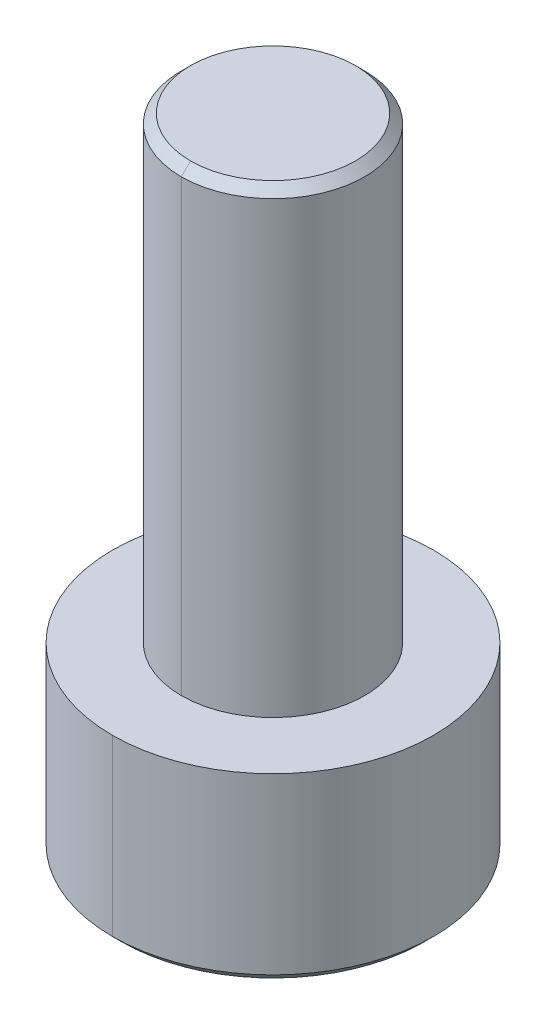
ISO-10303-21;
HEADER;
FILE_DESCRIPTION(('STEP AP214'),'2;1');
FILE_NAME('part.step','',(''),(''),'','','');
FILE_SCHEMA(('AUTOMOTIVE_DESIGN { 1 0 10303 214 1 1 1 1 }'));
ENDSEC;
DATA;
#1=APPLICATION_CONTEXT('core data for automotive mechanical design processes');
#2=APPLICATION_PROTOCOL_DEFINITION('international standard','automotive_design',2000,#1);
#3=PRODUCT_CONTEXT('',#1,'mechanical');
#4=PRODUCT('Part','Part','',(#3));
#5=PRODUCT_RELATED_PRODUCT_CATEGORY('part','',(#4));
#6=PRODUCT_DEFINITION_FORMATION('','',#4);
#7=PRODUCT_DEFINITION_CONTEXT('part definition',#1,'design');
#8=PRODUCT_DEFINITION('design','',#6,#7);
#9=PRODUCT_DEFINITION_SHAPE('','',#8);
#10=(LENGTH_UNIT() NAMED_UNIT(*) SI_UNIT(.MILLI.,.METRE.));
#11=(NAMED_UNIT(*) PLANE_ANGLE_UNIT() SI_UNIT($,.RADIAN.));
#12=(NAMED_UNIT(*) SI_UNIT($,.STERADIAN.) SOLID_ANGLE_UNIT());
#13=UNCERTAINTY_MEASURE_WITH_UNIT(LENGTH_MEASURE(1.E-05),#10,'distance_accuracy_value','');
#14=(GEOMETRIC_REPRESENTATION_CONTEXT(3) GLOBAL_UNCERTAINTY_ASSIGNED_CONTEXT((#13)) GLOBAL_UNIT_ASSIGNED_CONTEXT((#10,
#11,#12)) REPRESENTATION_CONTEXT('',''));
#15=CARTESIAN_POINT('',(0.,0.,0.));
#16=DIRECTION('',(0.,0.,1.));
#17=DIRECTION('',(1.,0.,0.));
#18=AXIS2_PLACEMENT_3D('',#15,#16,#17);
#19=CARTESIAN_POINT('',(0.,-28.5,-13.55));
#20=DIRECTION('',(0.,-1.,0.));
#21=DIRECTION('',(-1.,0.,0.));
#22=AXIS2_PLACEMENT_3D('',#19,#20,#21);
#23=PLANE('',#22);
#24=DIRECTION('',(-0.50000000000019,0.,-0.866025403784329));
#25=VECTOR('',#24,1.);
#26=CARTESIAN_POINT('',(0.866025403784,-28.5,-15.05));
#27=LINE('',#26,#25);
#28=CARTESIAN_POINT('',(1.732050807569,-28.5,-13.55));
#29=VERTEX_POINT('',#28);
#30=CARTESIAN_POINT('',(0.866025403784,-28.5,-15.05));
#31=VERTEX_POINT('',#30);
#32=EDGE_CURVE('E217',#29,#31,#27,.T.);
#33=ORIENTED_EDGE('',*,*,#32,.F.);
#34=DIRECTION('',(0.50000000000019,0.,-0.866025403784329));
#35=VECTOR('',#34,1.);
#36=CARTESIAN_POINT('',(1.732050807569,-28.5,-13.55));
#37=LINE('',#36,#35);
#38=CARTESIAN_POINT('',(0.866025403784,-28.5,-12.05));
#39=VERTEX_POINT('',#38);
#40=EDGE_CURVE('E10',#39,#29,#37,.T.);
#41=ORIENTED_EDGE('',*,*,#40,.F.);
#42=DIRECTION('',(1.,0.,0.));
#43=VECTOR('',#42,1.);
#44=CARTESIAN_POINT('',(0.866025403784,-28.5,-12.05));
#45=LINE('',#44,#43);
#46=CARTESIAN_POINT('',(-0.866025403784,-28.5,-12.05));
#47=VERTEX_POINT('',#46);
#48=EDGE_CURVE('E172',#47,#39,#45,.T.);
#49=ORIENTED_EDGE('',*,*,#48,.F.);
#50=DIRECTION('',(0.50000000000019,0.,0.866025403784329));
#51=VECTOR('',#50,1.);
#52=CARTESIAN_POINT('',(-0.866025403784,-28.5,-12.05));
#53=LINE('',#52,#51);
#54=CARTESIAN_POINT('',(-1.732050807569,-28.5,-13.55));
#55=VERTEX_POINT('',#54);
#56=EDGE_CURVE('E187',#55,#47,#53,.T.);
#57=ORIENTED_EDGE('',*,*,#56,.F.);
#58=DIRECTION('',(-0.50000000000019,0.,0.866025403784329));
#59=VECTOR('',#58,1.);
#60=CARTESIAN_POINT('',(-1.732050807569,-28.5,-13.55));
#61=LINE('',#60,#59);
#62=CARTESIAN_POINT('',(-0.866025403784,-28.5,-15.05));
#63=VERTEX_POINT('',#62);
#64=EDGE_CURVE('E215',#63,#55,#61,.T.);
#65=ORIENTED_EDGE('',*,*,#64,.F.);
#66=DIRECTION('',(-1.,0.,0.));
#67=VECTOR('',#66,1.);
#68=CARTESIAN_POINT('',(-0.866025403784,-28.5,-15.05));
#69=LINE('',#68,#67);
#70=EDGE_CURVE('E216',#31,#63,#69,.T.);
#71=ORIENTED_EDGE('',*,*,#70,.F.);
#72=EDGE_LOOP('',(#33,#41,#49,#57,#65,#71));
#73=FACE_BOUND('',#72,.T.);
#74=ADVANCED_FACE('F16',(#73),#23,.T.);
#75=CARTESIAN_POINT('',(1.732050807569,-28.5,-13.55));
#76=DIRECTION('',(-0.866025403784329,0.,-0.50000000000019));
#77=DIRECTION('',(-0.50000000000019,0.,0.866025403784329));
#78=AXIS2_PLACEMENT_3D('',#75,#76,#77);
#79=PLANE('',#78);
#80=DIRECTION('',(0.50000000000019,0.,-0.866025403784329));
#81=VECTOR('',#80,1.);
#82=CARTESIAN_POINT('',(1.732050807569,-30.5,-13.55));
#83=LINE('',#82,#81);
#84=CARTESIAN_POINT('',(0.866025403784,-30.5,-12.05));
#85=VERTEX_POINT('',#84);
#86=CARTESIAN_POINT('',(1.732050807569,-30.5,-13.55));
#87=VERTEX_POINT('',#86);
#88=EDGE_CURVE('E20',#85,#87,#83,.T.);
#89=ORIENTED_EDGE('',*,*,#88,.F.);
#90=DIRECTION('',(0.,-1.,0.));
#91=VECTOR('',#90,1.);
#92=CARTESIAN_POINT('',(0.866025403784,-28.5,-12.05));
#93=LINE('',#92,#91);
#94=EDGE_CURVE('E27',#39,#85,#93,.T.);
#95=ORIENTED_EDGE('',*,*,#94,.F.);
#96=ORIENTED_EDGE('',*,*,#40,.T.);
#97=DIRECTION('',(0.,-1.,0.));
#98=VECTOR('',#97,1.);
#99=CARTESIAN_POINT('',(1.732050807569,-28.5,-13.55));
#100=LINE('',#99,#98);
#101=EDGE_CURVE('E191',#29,#87,#100,.T.);
#102=ORIENTED_EDGE('',*,*,#101,.T.);
#103=EDGE_LOOP('',(#89,#95,#96,#102));
#104=FACE_BOUND('',#103,.T.);
#105=ADVANCED_FACE('F263',(#104),#79,.T.);
#106=CARTESIAN_POINT('',(0.866025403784,-28.5,-12.05));
#107=DIRECTION('',(0.,0.,-1.));
#108=DIRECTION('',(-1.,0.,0.));
#109=AXIS2_PLACEMENT_3D('',#106,#107,#108);
#110=PLANE('',#109);
#111=DIRECTION('',(1.,0.,0.));
#112=VECTOR('',#111,1.);
#113=CARTESIAN_POINT('',(0.866025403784,-30.5,-12.05));
#114=LINE('',#113,#112);
#115=CARTESIAN_POINT('',(-0.866025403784,-30.5,-12.05));
#116=VERTEX_POINT('',#115);
#117=EDGE_CURVE('E139',#116,#85,#114,.T.);
#118=ORIENTED_EDGE('',*,*,#117,.F.);
#119=DIRECTION('',(0.,-1.,0.));
#120=VECTOR('',#119,1.);
#121=CARTESIAN_POINT('',(-0.866025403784,-28.5,-12.05));
#122=LINE('',#121,#120);
#123=EDGE_CURVE('E180',#47,#116,#122,.T.);
#124=ORIENTED_EDGE('',*,*,#123,.F.);
#125=ORIENTED_EDGE('',*,*,#48,.T.);
#126=ORIENTED_EDGE('',*,*,#94,.T.);
#127=EDGE_LOOP('',(#118,#124,#125,#126));
#128=FACE_BOUND('',#127,.T.);
#129=ADVANCED_FACE('F18',(#128),#110,.T.);
#130=CARTESIAN_POINT('',(-0.866025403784,-28.5,-12.05));
#131=DIRECTION('',(0.866025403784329,0.,-0.50000000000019));
#132=DIRECTION('',(0.,-1.,0.));
#133=AXIS2_PLACEMENT_3D('',#130,#131,#132);
#134=PLANE('',#133);
#135=DIRECTION('',(0.50000000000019,0.,0.866025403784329));
#136=VECTOR('',#135,1.);
#137=CARTESIAN_POINT('',(-0.866025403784,-30.5,-12.05));
#138=LINE('',#137,#136);
#139=CARTESIAN_POINT('',(-1.732050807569,-30.5,-13.55));
#140=VERTEX_POINT('',#139);
#141=EDGE_CURVE('E170',#140,#116,#138,.T.);
#142=ORIENTED_EDGE('',*,*,#141,.F.);
#143=DIRECTION('',(0.,-1.,0.));
#144=VECTOR('',#143,1.);
#145=CARTESIAN_POINT('',(-1.732050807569,-28.5,-13.55));
#146=LINE('',#145,#144);
#147=EDGE_CURVE('E202',#55,#140,#146,.T.);
#148=ORIENTED_EDGE('',*,*,#147,.F.);
#149=ORIENTED_EDGE('',*,*,#56,.T.);
#150=ORIENTED_EDGE('',*,*,#123,.T.);
#151=EDGE_LOOP('',(#142,#148,#149,#150));
#152=FACE_BOUND('',#151,.T.);
#153=ADVANCED_FACE('F260',(#152),#134,.T.);
#154=CARTESIAN_POINT('',(-1.732050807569,-28.5,-13.55));
#155=DIRECTION('',(0.866025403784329,0.,0.50000000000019));
#156=DIRECTION('',(0.,-1.,0.));
#157=AXIS2_PLACEMENT_3D('',#154,#155,#156);
#158=PLANE('',#157);
#159=DIRECTION('',(-0.50000000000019,0.,0.866025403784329));
#160=VECTOR('',#159,1.);
#161=CARTESIAN_POINT('',(-1.732050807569,-30.5,-13.55));
#162=LINE('',#161,#160);
#163=CARTESIAN_POINT('',(-0.866025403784,-30.5,-15.05));
#164=VERTEX_POINT('',#163);
#165=EDGE_CURVE('E210',#164,#140,#162,.T.);
#166=ORIENTED_EDGE('',*,*,#165,.F.);
#167=DIRECTION('',(0.,-1.,0.));
#168=VECTOR('',#167,1.);
#169=CARTESIAN_POINT('',(-0.866025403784,-28.5,-15.05));
#170=LINE('',#169,#168);
#171=EDGE_CURVE('E212',#63,#164,#170,.T.);
#172=ORIENTED_EDGE('',*,*,#171,.F.);
#173=ORIENTED_EDGE('',*,*,#64,.T.);
#174=ORIENTED_EDGE('',*,*,#147,.T.);
#175=EDGE_LOOP('',(#166,#172,#173,#174));
#176=FACE_BOUND('',#175,.T.);
#177=ADVANCED_FACE('F269',(#176),#158,.T.);
#178=CARTESIAN_POINT('',(-0.866025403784,-28.5,-15.05));
#179=DIRECTION('',(0.,0.,1.));
#180=DIRECTION('',(1.,0.,0.));
#181=AXIS2_PLACEMENT_3D('',#178,#179,#180);
#182=PLANE('',#181);
#183=DIRECTION('',(-1.,0.,0.));
#184=VECTOR('',#183,1.);
#185=CARTESIAN_POINT('',(-0.866025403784,-30.5,-15.05));
#186=LINE('',#185,#184);
#187=CARTESIAN_POINT('',(0.866025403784,-30.5,-15.05));
#188=VERTEX_POINT('',#187);
#189=EDGE_CURVE('E206',#188,#164,#186,.T.);
#190=ORIENTED_EDGE('',*,*,#189,.F.);
#191=DIRECTION('',(0.,-1.,0.));
#192=VECTOR('',#191,1.);
#193=CARTESIAN_POINT('',(0.866025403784,-28.5,-15.05));
#194=LINE('',#193,#192);
#195=EDGE_CURVE('E221',#31,#188,#194,.T.);
#196=ORIENTED_EDGE('',*,*,#195,.F.);
#197=ORIENTED_EDGE('',*,*,#70,.T.);
#198=ORIENTED_EDGE('',*,*,#171,.T.);
#199=EDGE_LOOP('',(#190,#196,#197,#198));
#200=FACE_BOUND('',#199,.T.);
#201=ADVANCED_FACE('F291',(#200),#182,.T.);
#202=CARTESIAN_POINT('',(0.866025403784,-28.5,-15.05));
#203=DIRECTION('',(-0.866025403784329,0.,0.50000000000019));
#204=DIRECTION('',(0.,1.,0.));
#205=AXIS2_PLACEMENT_3D('',#202,#203,#204);
#206=PLANE('',#205);
#207=DIRECTION('',(-0.50000000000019,0.,-0.866025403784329));
#208=VECTOR('',#207,1.);
#209=CARTESIAN_POINT('',(0.866025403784,-30.5,-15.05));
#210=LINE('',#209,#208);
#211=EDGE_CURVE('E211',#87,#188,#210,.T.);
#212=ORIENTED_EDGE('',*,*,#211,.F.);
#213=ORIENTED_EDGE('',*,*,#101,.F.);
#214=ORIENTED_EDGE('',*,*,#32,.T.);
#215=ORIENTED_EDGE('',*,*,#195,.T.);
#216=EDGE_LOOP('',(#212,#213,#214,#215));
#217=FACE_BOUND('',#216,.T.);
#218=ADVANCED_FACE('F299',(#217),#206,.T.);
#219=CARTESIAN_POINT('',(1.8,-16.5,-13.55));
#220=DIRECTION('',(0.,1.,0.));
#221=DIRECTION('',(0.,0.,-1.));
#222=AXIS2_PLACEMENT_3D('',#219,#220,#221);
#223=PLANE('',#222);
#224=CARTESIAN_POINT('',(0.,-16.5,-13.55));
#225=DIRECTION('',(0.,-1.,0.));
#226=DIRECTION('',(0.,0.,-1.));
#227=AXIS2_PLACEMENT_3D('',#224,#225,#226);
#228=CIRCLE('',#227,1.8);
#229=CARTESIAN_POINT('',(0.,-16.5,-15.35));
#230=VERTEX_POINT('',#229);
#231=CARTESIAN_POINT('',(0.,-16.5,-11.75));
#232=VERTEX_POINT('',#231);
#233=EDGE_CURVE('E330',#230,#232,#228,.T.);
#234=ORIENTED_EDGE('',*,*,#233,.F.);
#235=CARTESIAN_POINT('',(0.,-16.5,-13.55));
#236=DIRECTION('',(0.,-1.,0.));
#237=DIRECTION('',(0.,0.,-1.));
#238=AXIS2_PLACEMENT_3D('',#235,#236,#237);
#239=CIRCLE('',#238,1.8);
#240=EDGE_CURVE('E195',#232,#230,#239,.T.);
#241=ORIENTED_EDGE('',*,*,#240,.F.);
#242=EDGE_LOOP('',(#234,#241));
#243=FACE_BOUND('',#242,.T.);
#244=ADVANCED_FACE('F295',(#243),#223,.T.);
#245=CARTESIAN_POINT('',(0.,-16.7,-13.55));
#246=DIRECTION('',(0.,-1.,0.));
#247=DIRECTION('',(0.,0.,-1.));
#248=AXIS2_PLACEMENT_3D('',#245,#246,#247);
#249=CONICAL_SURFACE('',#248,2.,0.785398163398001);
#250=DIRECTION('',(0.,-0.707106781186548,0.707106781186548));
#251=VECTOR('',#250,1.);
#252=CARTESIAN_POINT('',(0.,-16.7,-11.55));
#253=LINE('',#252,#251);
#254=CARTESIAN_POINT('',(0.,-16.7,-11.55));
#255=VERTEX_POINT('',#254);
#256=EDGE_CURVE('E242',#232,#255,#253,.T.);
#257=ORIENTED_EDGE('',*,*,#256,.F.);
#258=ORIENTED_EDGE('',*,*,#240,.T.);
#259=DIRECTION('',(0.,-0.707106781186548,-0.707106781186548));
#260=VECTOR('',#259,1.);
#261=CARTESIAN_POINT('',(0.,-16.7,-15.55));
#262=LINE('',#261,#260);
#263=CARTESIAN_POINT('',(0.,-16.7,-15.55));
#264=VERTEX_POINT('',#263);
#265=EDGE_CURVE('E233',#230,#264,#262,.T.);
#266=ORIENTED_EDGE('',*,*,#265,.T.);
#267=CARTESIAN_POINT('',(0.,-16.7,-13.55));
#268=DIRECTION('',(0.,-1.,0.));
#269=DIRECTION('',(0.,0.,-1.));
#270=AXIS2_PLACEMENT_3D('',#267,#268,#269);
#271=CIRCLE('',#270,2.);
#272=EDGE_CURVE('E193',#255,#264,#271,.T.);
#273=ORIENTED_EDGE('',*,*,#272,.F.);
#274=EDGE_LOOP('',(#257,#258,#266,#273));
#275=FACE_BOUND('',#274,.T.);
#276=ADVANCED_FACE('F298',(#275),#249,.T.);
#277=CARTESIAN_POINT('',(0.,-526.5,-13.55));
#278=DIRECTION('',(0.,-1.,0.));
#279=DIRECTION('',(0.,0.,-1.));
#280=AXIS2_PLACEMENT_3D('',#277,#278,#279);
#281=CYLINDRICAL_SURFACE('',#280,2.);
#282=DIRECTION('',(0.,-1.,0.));
#283=VECTOR('',#282,1.);
#284=CARTESIAN_POINT('',(0.,-526.5,-11.55));
#285=LINE('',#284,#283);
#286=CARTESIAN_POINT('',(0.,-26.5,-11.55));
#287=VERTEX_POINT('',#286);
#288=EDGE_CURVE('E230',#255,#287,#285,.T.);
#289=ORIENTED_EDGE('',*,*,#288,.F.);
#290=ORIENTED_EDGE('',*,*,#272,.T.);
#291=DIRECTION('',(0.,-1.,0.));
#292=VECTOR('',#291,1.);
#293=CARTESIAN_POINT('',(0.,-526.5,-15.55));
#294=LINE('',#293,#292);
#295=CARTESIAN_POINT('',(0.,-26.5,-15.55));
#296=VERTEX_POINT('',#295);
#297=EDGE_CURVE('E167',#264,#296,#294,.T.);
#298=ORIENTED_EDGE('',*,*,#297,.T.);
#299=CARTESIAN_POINT('',(0.,-26.5,-13.55));
#300=DIRECTION('',(0.,-1.,0.));
#301=DIRECTION('',(0.,0.,-1.));
#302=AXIS2_PLACEMENT_3D('',#299,#300,#301);
#303=CIRCLE('',#302,2.);
#304=EDGE_CURVE('E196',#287,#296,#303,.T.);
#305=ORIENTED_EDGE('',*,*,#304,.F.);
#306=EDGE_LOOP('',(#289,#290,#298,#305));
#307=FACE_BOUND('',#306,.T.);
#308=ADVANCED_FACE('F301',(#307),#281,.T.);
#309=CARTESIAN_POINT('',(3.5,-26.5,-13.55));
#310=DIRECTION('',(0.,1.,0.));
#311=DIRECTION('',(0.,0.,-1.));
#312=AXIS2_PLACEMENT_3D('',#309,#310,#311);
#313=PLANE('',#312);
#314=CARTESIAN_POINT('',(0.,-26.5,-13.55));
#315=DIRECTION('',(0.,-1.,0.));
#316=DIRECTION('',(0.,0.,-1.));
#317=AXIS2_PLACEMENT_3D('',#314,#315,#316);
#318=CIRCLE('',#317,3.5);
#319=CARTESIAN_POINT('',(0.,-26.5,-17.05));
#320=VERTEX_POINT('',#319);
#321=CARTESIAN_POINT('',(0.,-26.5,-10.05));
#322=VERTEX_POINT('',#321);
#323=EDGE_CURVE('E160',#320,#322,#318,.T.);
#324=ORIENTED_EDGE('',*,*,#323,.F.);
#325=CARTESIAN_POINT('',(0.,-26.5,-13.55));
#326=DIRECTION('',(0.,-1.,0.));
#327=DIRECTION('',(0.,0.,-1.));
#328=AXIS2_PLACEMENT_3D('',#325,#326,#327);
#329=CIRCLE('',#328,3.5);
#330=EDGE_CURVE('E138',#322,#320,#329,.T.);
#331=ORIENTED_EDGE('',*,*,#330,.F.);
#332=EDGE_LOOP('',(#324,#331));
#333=FACE_BOUND('',#332,.T.);
#334=CARTESIAN_POINT('',(0.,-26.5,-13.55));
#335=DIRECTION('',(0.,-1.,0.));
#336=DIRECTION('',(0.,0.,-1.));
#337=AXIS2_PLACEMENT_3D('',#334,#335,#336);
#338=CIRCLE('',#337,2.);
#339=EDGE_CURVE('E229',#296,#287,#338,.T.);
#340=ORIENTED_EDGE('',*,*,#339,.T.);
#341=ORIENTED_EDGE('',*,*,#304,.T.);
#342=EDGE_LOOP('',(#340,#341));
#343=FACE_BOUND('',#342,.T.);
#344=ADVANCED_FACE('F281',(#333,#343),#313,.T.);
#345=CARTESIAN_POINT('',(0.,-526.5,-13.55));
#346=DIRECTION('',(0.,-1.,0.));
#347=DIRECTION('',(0.,0.,-1.));
#348=AXIS2_PLACEMENT_3D('',#345,#346,#347);
#349=CYLINDRICAL_SURFACE('',#348,3.5);
#350=DIRECTION('',(0.,-1.,0.));
#351=VECTOR('',#350,1.);
#352=CARTESIAN_POINT('',(0.,-526.5,-10.05));
#353=LINE('',#352,#351);
#354=CARTESIAN_POINT('',(0.,-30.3,-10.05));
#355=VERTEX_POINT('',#354);
#356=EDGE_CURVE('E129',#322,#355,#353,.T.);
#357=ORIENTED_EDGE('',*,*,#356,.F.);
#358=ORIENTED_EDGE('',*,*,#330,.T.);
#359=DIRECTION('',(0.,-1.,0.));
#360=VECTOR('',#359,1.);
#361=CARTESIAN_POINT('',(0.,-526.5,-17.05));
#362=LINE('',#361,#360);
#363=CARTESIAN_POINT('',(0.,-30.3,-17.05));
#364=VERTEX_POINT('',#363);
#365=EDGE_CURVE('E132',#320,#364,#362,.T.);
#366=ORIENTED_EDGE('',*,*,#365,.T.);
#367=CARTESIAN_POINT('',(0.,-30.3,-13.55));
#368=DIRECTION('',(0.,-1.,0.));
#369=DIRECTION('',(0.,0.,-1.));
#370=AXIS2_PLACEMENT_3D('',#367,#368,#369);
#371=CIRCLE('',#370,3.5);
#372=EDGE_CURVE('E125',#355,#364,#371,.T.);
#373=ORIENTED_EDGE('',*,*,#372,.F.);
#374=EDGE_LOOP('',(#357,#358,#366,#373));
#375=FACE_BOUND('',#374,.T.);
#376=ADVANCED_FACE('F127',(#375),#349,.T.);
#377=CARTESIAN_POINT('',(0.,-30.5,-13.55));
#378=DIRECTION('',(0.,1.,0.));
#379=DIRECTION('',(0.,0.,1.));
#380=AXIS2_PLACEMENT_3D('',#377,#378,#379);
#381=CONICAL_SURFACE('',#380,3.3,0.785398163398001);
#382=DIRECTION('',(0.,0.707106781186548,-0.707106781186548));
#383=VECTOR('',#382,1.);
#384=CARTESIAN_POINT('',(0.,-30.5,-16.85));
#385=LINE('',#384,#383);
#386=CARTESIAN_POINT('',(0.,-30.5,-16.85));
#387=VERTEX_POINT('',#386);
#388=EDGE_CURVE('E151',#387,#364,#385,.T.);
#389=ORIENTED_EDGE('',*,*,#388,.F.);
#390=CARTESIAN_POINT('',(0.,-30.5,-13.55));
#391=DIRECTION('',(0.,-1.,0.));
#392=DIRECTION('',(0.,0.,-1.));
#393=AXIS2_PLACEMENT_3D('',#390,#391,#392);
#394=CIRCLE('',#393,3.3);
#395=CARTESIAN_POINT('',(0.,-30.5,-10.25));
#396=VERTEX_POINT('',#395);
#397=EDGE_CURVE('E146',#396,#387,#394,.T.);
#398=ORIENTED_EDGE('',*,*,#397,.F.);
#399=DIRECTION('',(0.,0.707106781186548,0.707106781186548));
#400=VECTOR('',#399,1.);
#401=CARTESIAN_POINT('',(0.,-30.5,-10.25));
#402=LINE('',#401,#400);
#403=EDGE_CURVE('E143',#396,#355,#402,.T.);
#404=ORIENTED_EDGE('',*,*,#403,.T.);
#405=ORIENTED_EDGE('',*,*,#372,.T.);
#406=EDGE_LOOP('',(#389,#398,#404,#405));
#407=FACE_BOUND('',#406,.T.);
#408=ADVANCED_FACE('F145',(#407),#381,.T.);
#409=CARTESIAN_POINT('',(0.,-30.5,-13.55));
#410=DIRECTION('',(0.,-1.,0.));
#411=DIRECTION('',(-1.,0.,0.));
#412=AXIS2_PLACEMENT_3D('',#409,#410,#411);
#413=PLANE('',#412);
#414=ORIENTED_EDGE('',*,*,#88,.T.);
#415=ORIENTED_EDGE('',*,*,#211,.T.);
#416=ORIENTED_EDGE('',*,*,#189,.T.);
#417=ORIENTED_EDGE('',*,*,#165,.T.);
#418=ORIENTED_EDGE('',*,*,#141,.T.);
#419=ORIENTED_EDGE('',*,*,#117,.T.);
#420=EDGE_LOOP('',(#414,#415,#416,#417,#418,#419));
#421=FACE_BOUND('',#420,.T.);
#422=ORIENTED_EDGE('',*,*,#397,.T.);
#423=CARTESIAN_POINT('',(0.,-30.5,-13.55));
#424=DIRECTION('',(0.,-1.,0.));
#425=DIRECTION('',(0.,0.,-1.));
#426=AXIS2_PLACEMENT_3D('',#423,#424,#425);
#427=CIRCLE('',#426,3.3);
#428=EDGE_CURVE('E199',#387,#396,#427,.T.);
#429=ORIENTED_EDGE('',*,*,#428,.T.);
#430=EDGE_LOOP('',(#422,#429));
#431=FACE_BOUND('',#430,.T.);
#432=ADVANCED_FACE('F255',(#421,#431),#413,.T.);
#433=CARTESIAN_POINT('',(0.,-30.5,-13.55));
#434=DIRECTION('',(0.,1.,0.));
#435=DIRECTION('',(0.,0.,1.));
#436=AXIS2_PLACEMENT_3D('',#433,#434,#435);
#437=CONICAL_SURFACE('',#436,3.3,0.785398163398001);
#438=ORIENTED_EDGE('',*,*,#428,.F.);
#439=ORIENTED_EDGE('',*,*,#388,.T.);
#440=CARTESIAN_POINT('',(0.,-30.3,-13.55));
#441=DIRECTION('',(0.,-1.,0.));
#442=DIRECTION('',(0.,0.,-1.));
#443=AXIS2_PLACEMENT_3D('',#440,#441,#442);
#444=CIRCLE('',#443,3.5);
#445=EDGE_CURVE('E153',#364,#355,#444,.T.);
#446=ORIENTED_EDGE('',*,*,#445,.T.);
#447=ORIENTED_EDGE('',*,*,#403,.F.);
#448=EDGE_LOOP('',(#438,#439,#446,#447));
#449=FACE_BOUND('',#448,.T.);
#450=ADVANCED_FACE('F154',(#449),#437,.T.);
#451=CARTESIAN_POINT('',(0.,-526.5,-13.55));
#452=DIRECTION('',(0.,-1.,0.));
#453=DIRECTION('',(0.,0.,-1.));
#454=AXIS2_PLACEMENT_3D('',#451,#452,#453);
#455=CYLINDRICAL_SURFACE('',#454,3.5);
#456=ORIENTED_EDGE('',*,*,#323,.T.);
#457=ORIENTED_EDGE('',*,*,#356,.T.);
#458=ORIENTED_EDGE('',*,*,#445,.F.);
#459=ORIENTED_EDGE('',*,*,#365,.F.);
#460=EDGE_LOOP('',(#456,#457,#458,#459));
#461=FACE_BOUND('',#460,.T.);
#462=ADVANCED_FACE('F158',(#461),#455,.T.);
#463=CARTESIAN_POINT('',(0.,-526.5,-13.55));
#464=DIRECTION('',(0.,-1.,0.));
#465=DIRECTION('',(0.,0.,-1.));
#466=AXIS2_PLACEMENT_3D('',#463,#464,#465);
#467=CYLINDRICAL_SURFACE('',#466,2.);
#468=CARTESIAN_POINT('',(0.,-16.7,-13.55));
#469=DIRECTION('',(0.,-1.,0.));
#470=DIRECTION('',(0.,0.,-1.));
#471=AXIS2_PLACEMENT_3D('',#468,#469,#470);
#472=CIRCLE('',#471,2.);
#473=EDGE_CURVE('E239',#264,#255,#472,.T.);
#474=ORIENTED_EDGE('',*,*,#473,.T.);
#475=ORIENTED_EDGE('',*,*,#288,.T.);
#476=ORIENTED_EDGE('',*,*,#339,.F.);
#477=ORIENTED_EDGE('',*,*,#297,.F.);
#478=EDGE_LOOP('',(#474,#475,#476,#477));
#479=FACE_BOUND('',#478,.T.);
#480=ADVANCED_FACE('F282',(#479),#467,.T.);
#481=CARTESIAN_POINT('',(0.,-16.7,-13.55));
#482=DIRECTION('',(0.,-1.,0.));
#483=DIRECTION('',(0.,0.,-1.));
#484=AXIS2_PLACEMENT_3D('',#481,#482,#483);
#485=CONICAL_SURFACE('',#484,2.,0.785398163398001);
#486=ORIENTED_EDGE('',*,*,#233,.T.);
#487=ORIENTED_EDGE('',*,*,#256,.T.);
#488=ORIENTED_EDGE('',*,*,#473,.F.);
#489=ORIENTED_EDGE('',*,*,#265,.F.);
#490=EDGE_LOOP('',(#486,#487,#488,#489));
#491=FACE_BOUND('',#490,.T.);
#492=ADVANCED_FACE('F285',(#491),#485,.T.);
#493=CLOSED_SHELL('',(#74,#105,#129,#153,#177,#201,#218,#244,#276,#308,#344,#376,#408,#432,#450,
#462,#480,#492));
#494=MANIFOLD_SOLID_BREP('B1',#493);
#495=ADVANCED_BREP_SHAPE_REPRESENTATION('',(#18,#494),#14);
#496=SHAPE_DEFINITION_REPRESENTATION(#9,#495);
ENDSEC;
END-ISO-10303-21;
